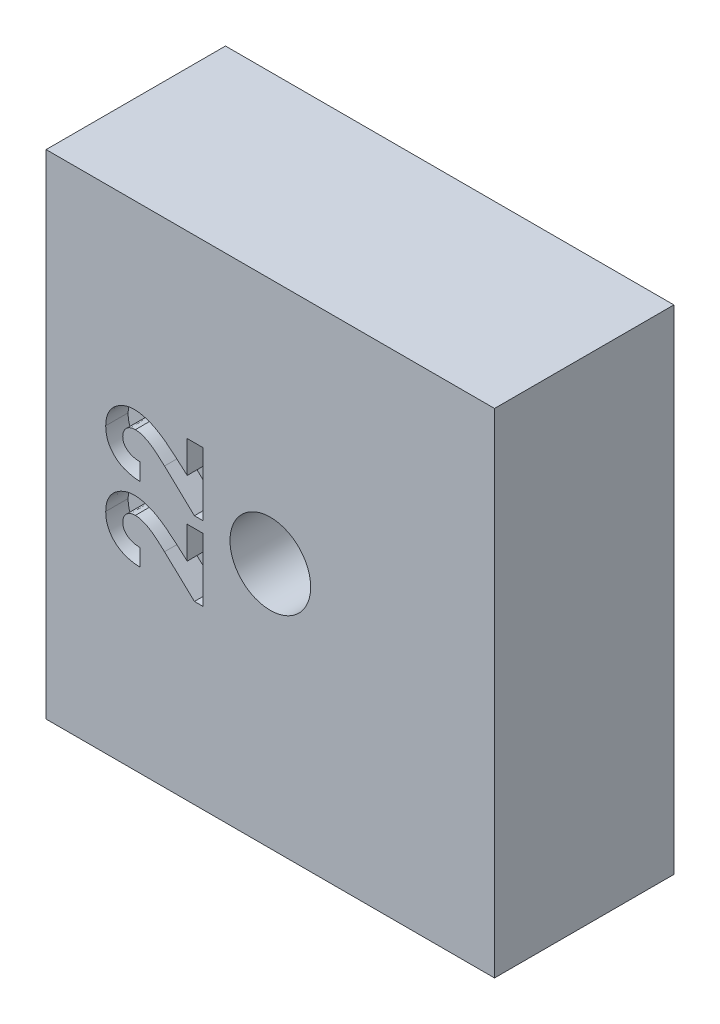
from build123d import *

# Parameters (mm, degrees)
SKETCH1_W           = 20
SKETCH1_H           = 22
SKETCH1_R           = 1.8
BOSS_EXTRUDE1_DEPTH = 8
CUT_EXTRUDE1_DEPTH  = 1


with BuildPart() as part:
    # Sketch1 → Boss-Extrude1 (new body)
    with BuildSketch(Plane.XY):
        with Locations((-2.245418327, 4.029083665)):
            Rectangle(SKETCH1_W, SKETCH1_H)
        with Locations((-2.245418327, 4.029083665)):
            Circle(SKETCH1_R, mode=Mode.SUBTRACT)
    extrude(amount=BOSS_EXTRUDE1_DEPTH)

    # Sketch3 → Cut-Extrude1 (cut)
    with BuildSketch(Plane.XY.offset(8)):
        with BuildLine():
            Line((-8.067640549, 1.749596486), (-8.067640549, 0.989767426))
            add(Edge.make_bspline(
                [(-8.067640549, 0.989767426), (-8.125118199, 0.993047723), (-8.237426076, 0.999457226), (-8.400546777, 1.024980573), (-8.554715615, 1.059093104), (-8.6994691, 1.105009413), (-8.834868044, 1.161565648), (-8.960463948, 1.230169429), (-9.077156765, 1.308772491), (-9.182899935, 1.398959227), (-9.277966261, 1.497069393), (-9.361075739, 1.602851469), (-9.43064924, 1.716004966), (-9.487720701, 1.835773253), (-9.53338522, 1.961685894), (-9.563899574, 2.095015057), (-9.584568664, 2.234584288), (-9.586377, 2.330131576), (-9.587298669, 2.378829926)],
                knots=[0, 0, 0, 0, 1.198928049, 2.342633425, 3.435730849, 4.486331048, 5.502589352, 6.488331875, 7.46361919, 8.428949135, 9.378681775, 10.305958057, 11.226249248, 12.140413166, 13.066341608, 14.010670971, 14.986082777, 16, 16, 16, 16], degree=3))
            add(Edge.make_bspline(
                [(-9.587298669, 2.378829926), (-9.585558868, 2.438633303), (-9.582160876, 2.555434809), (-9.549344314, 2.724592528), (-9.499091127, 2.883421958), (-9.426080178, 3.030233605), (-9.334012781, 3.16477222), (-9.224023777, 3.286289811), (-9.094776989, 3.3924164), (-8.949994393, 3.482324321), (-8.796383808, 3.556673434), (-8.637834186, 3.609274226), (-8.478437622, 3.643665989), (-8.371120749, 3.647342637), (-8.317807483, 3.649169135)],
                knots=[0, 0, 0, 0, 1.075374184, 2.100304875, 3.089917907, 4.066149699, 5.039978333, 6.01615708, 7.006437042, 8.039858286, 9.077679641, 10.07047942, 11.041445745, 12, 12, 12, 12], degree=3))
            add(Edge.make_bspline(
                [(-8.317807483, 3.649169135), (-8.285559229, 3.648458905), (-8.22065146, 3.647029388), (-8.122430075, 3.637089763), (-8.022380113, 3.622178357), (-7.920587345, 3.599695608), (-7.81702329, 3.571657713), (-7.711377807, 3.537643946), (-7.604250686, 3.496864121), (-7.494433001, 3.450003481), (-7.381581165, 3.394082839), (-7.263950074, 3.329035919), (-7.141664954, 3.252688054), (-7.013526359, 3.167524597), (-6.88149082, 3.070195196), (-6.744092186, 2.963278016), (-6.601546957, 2.846234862), (-6.506220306, 2.763229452), (-6.457243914, 2.720583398)],
                knots=[0, 0, 0, 0, 0.728277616, 1.465842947, 2.227925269, 3.011838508, 3.818735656, 4.650581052, 5.517389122, 6.406849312, 7.346234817, 8.360743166, 9.441530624, 10.601362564, 11.834937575, 13.145232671, 14.533293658, 16, 16, 16, 16], degree=3))
            Line((-6.457243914, 2.720583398), (-5.950973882, 2.278763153))
            Line((-5.950973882, 2.278763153), (-5.950973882, 3.70344264))
            Line((-5.950973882, 3.70344264), (-5.245418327, 3.70344264))
            Line((-5.245418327, 3.70344264), (-5.245418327, 0.881220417))
            Line((-5.245418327, 0.881220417), (-5.630420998, 0.881220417))
            Line((-5.630420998, 0.881220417), (-6.96436197, 2.134599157))
            add(Edge.make_bspline(
                [(-6.96436197, 2.134599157), (-7.003273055, 2.170888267), (-7.078632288, 2.241169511), (-7.189311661, 2.341163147), (-7.294321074, 2.431681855), (-7.394878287, 2.51070165), (-7.487578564, 2.583003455), (-7.57592633, 2.643489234), (-7.657433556, 2.696164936), (-7.756787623, 2.751190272), (-7.874390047, 2.804648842), (-8.009789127, 2.853669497), (-8.13929021, 2.883251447), (-8.223826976, 2.887366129), (-8.264382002, 2.889340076)],
                knots=[0, 0, 0, 0, 1.246192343, 2.413505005, 3.49357156, 4.492416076, 5.408771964, 6.246246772, 6.999304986, 7.680960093, 8.904522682, 10.020616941, 11.0504258, 12, 12, 12, 12], degree=3))
            add(Edge.make_bspline(
                [(-8.264382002, 2.889340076), (-8.303617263, 2.887868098), (-8.379641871, 2.885015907), (-8.487786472, 2.853672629), (-8.585700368, 2.805114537), (-8.670457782, 2.736689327), (-8.740108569, 2.653804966), (-8.791912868, 2.558024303), (-8.821803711, 2.45012823), (-8.825544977, 2.374491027), (-8.827469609, 2.335580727)],
                knots=[0, 0, 0, 0, 1.062038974, 2.057870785, 3.028805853, 4.01125022, 4.991535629, 5.949134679, 6.94496649, 8, 8, 8, 8], degree=3))
            add(Edge.make_bspline(
                [(-8.827469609, 2.335580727), (-8.826758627, 2.315479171), (-8.825358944, 2.275906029), (-8.816041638, 2.217736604), (-8.799620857, 2.162384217), (-8.777619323, 2.109232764), (-8.748456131, 2.058849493), (-8.71250785, 2.011361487), (-8.670688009, 1.966268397), (-8.623127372, 1.923777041), (-8.570049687, 1.88510436), (-8.51193971, 1.850755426), (-8.448833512, 1.822354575), (-8.381564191, 1.797349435), (-8.30940922, 1.778064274), (-8.232800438, 1.764022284), (-8.151862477, 1.753347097), (-8.09622524, 1.750869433), (-8.067640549, 1.749596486)],
                knots=[0, 0, 0, 0, 0.903469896, 1.778625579, 2.63899355, 3.493148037, 4.358286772, 5.247621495, 6.164656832, 7.118446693, 8.109501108, 9.111810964, 10.146451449, 11.215617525, 12.33435995, 13.498009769, 14.714554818, 16, 16, 16, 16], degree=3))
        make_face()
        with BuildLine():
            Line((-8.067640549, 5.060280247), (-8.067640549, 4.300451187))
            add(Edge.make_bspline(
                [(-8.067640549, 4.300451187), (-8.125118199, 4.303731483), (-8.237426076, 4.310140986), (-8.400546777, 4.335664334), (-8.554715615, 4.369776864), (-8.6994691, 4.415693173), (-8.834868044, 4.472249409), (-8.960463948, 4.540853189), (-9.077156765, 4.619456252), (-9.182899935, 4.709642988), (-9.277966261, 4.807753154), (-9.361075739, 4.91353523), (-9.43064924, 5.026688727), (-9.487720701, 5.146457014), (-9.53338522, 5.272369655), (-9.563899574, 5.405698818), (-9.584568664, 5.545268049), (-9.586377, 5.640815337), (-9.587298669, 5.689513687)],
                knots=[0, 0, 0, 0, 1.198928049, 2.342633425, 3.435730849, 4.486331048, 5.502589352, 6.488331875, 7.46361919, 8.428949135, 9.378681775, 10.305958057, 11.226249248, 12.140413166, 13.066341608, 14.010670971, 14.986082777, 16, 16, 16, 16], degree=3))
            add(Edge.make_bspline(
                [(-9.587298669, 5.689513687), (-9.585558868, 5.749317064), (-9.582160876, 5.86611857), (-9.549344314, 6.035276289), (-9.499091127, 6.194105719), (-9.426080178, 6.340917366), (-9.334012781, 6.47545598), (-9.224023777, 6.596973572), (-9.094776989, 6.703100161), (-8.949994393, 6.793008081), (-8.796383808, 6.867357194), (-8.637834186, 6.919957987), (-8.478437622, 6.954349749), (-8.371120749, 6.958026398), (-8.317807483, 6.959852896)],
                knots=[0, 0, 0, 0, 1.075374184, 2.100304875, 3.089917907, 4.066149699, 5.039978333, 6.01615708, 7.006437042, 8.039858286, 9.077679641, 10.07047942, 11.041445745, 12, 12, 12, 12], degree=3))
            add(Edge.make_bspline(
                [(-8.317807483, 6.959852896), (-8.285559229, 6.959142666), (-8.22065146, 6.957713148), (-8.122430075, 6.947773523), (-8.022380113, 6.932862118), (-7.920587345, 6.910379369), (-7.81702329, 6.882341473), (-7.711377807, 6.848327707), (-7.604250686, 6.807547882), (-7.494433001, 6.760687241), (-7.381581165, 6.7047666), (-7.263950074, 6.63971968), (-7.141664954, 6.563371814), (-7.013526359, 6.478208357), (-6.88149082, 6.380878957), (-6.744092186, 6.273961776), (-6.601546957, 6.156918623), (-6.506220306, 6.073913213), (-6.457243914, 6.031267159)],
                knots=[0, 0, 0, 0, 0.728277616, 1.465842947, 2.227925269, 3.011838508, 3.818735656, 4.650581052, 5.517389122, 6.406849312, 7.346234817, 8.360743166, 9.441530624, 10.601362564, 11.834937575, 13.145232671, 14.533293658, 16, 16, 16, 16], degree=3))
            Line((-6.457243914, 6.031267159), (-5.950973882, 5.589446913))
            Line((-5.950973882, 5.589446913), (-5.950973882, 7.0141264))
            Line((-5.950973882, 7.0141264), (-5.245418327, 7.0141264))
            Line((-5.245418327, 7.0141264), (-5.245418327, 4.191904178))
            Line((-5.245418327, 4.191904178), (-5.630420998, 4.191904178))
            Line((-5.630420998, 4.191904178), (-6.96436197, 5.445282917))
            add(Edge.make_bspline(
                [(-6.96436197, 5.445282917), (-7.003273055, 5.481572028), (-7.078632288, 5.551853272), (-7.189311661, 5.651846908), (-7.294321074, 5.742365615), (-7.394878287, 5.821385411), (-7.487578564, 5.893687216), (-7.57592633, 5.954172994), (-7.657433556, 6.006848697), (-7.756787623, 6.061874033), (-7.874390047, 6.115332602), (-8.009789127, 6.164353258), (-8.13929021, 6.193935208), (-8.223826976, 6.19804989), (-8.264382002, 6.200023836)],
                knots=[0, 0, 0, 0, 1.246192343, 2.413505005, 3.49357156, 4.492416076, 5.408771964, 6.246246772, 6.999304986, 7.680960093, 8.904522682, 10.020616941, 11.0504258, 12, 12, 12, 12], degree=3))
            add(Edge.make_bspline(
                [(-8.264382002, 6.200023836), (-8.303617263, 6.198551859), (-8.379641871, 6.195699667), (-8.487786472, 6.16435639), (-8.585700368, 6.115798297), (-8.670457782, 6.047373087), (-8.740108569, 5.964488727), (-8.791912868, 5.868708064), (-8.821803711, 5.76081199), (-8.825544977, 5.685174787), (-8.827469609, 5.646264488)],
                knots=[0, 0, 0, 0, 1.062038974, 2.057870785, 3.028805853, 4.01125022, 4.991535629, 5.949134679, 6.94496649, 8, 8, 8, 8], degree=3))
            add(Edge.make_bspline(
                [(-8.827469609, 5.646264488), (-8.826758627, 5.626162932), (-8.825358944, 5.58658979), (-8.816041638, 5.528420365), (-8.799620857, 5.473067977), (-8.777619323, 5.419916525), (-8.748456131, 5.369533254), (-8.71250785, 5.322045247), (-8.670688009, 5.276952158), (-8.623127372, 5.234460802), (-8.570049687, 5.195788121), (-8.51193971, 5.161439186), (-8.448833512, 5.133038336), (-8.381564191, 5.108033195), (-8.30940922, 5.088748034), (-8.232800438, 5.074706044), (-8.151862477, 5.064030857), (-8.09622524, 5.061553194), (-8.067640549, 5.060280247)],
                knots=[0, 0, 0, 0, 0.903469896, 1.778625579, 2.63899355, 3.493148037, 4.358286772, 5.247621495, 6.164656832, 7.118446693, 8.109501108, 9.111810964, 10.146451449, 11.215617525, 12.33435995, 13.498009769, 14.714554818, 16, 16, 16, 16], degree=3))
        make_face()
    extrude(amount=-CUT_EXTRUDE1_DEPTH, mode=Mode.SUBTRACT)


solid = part.part
